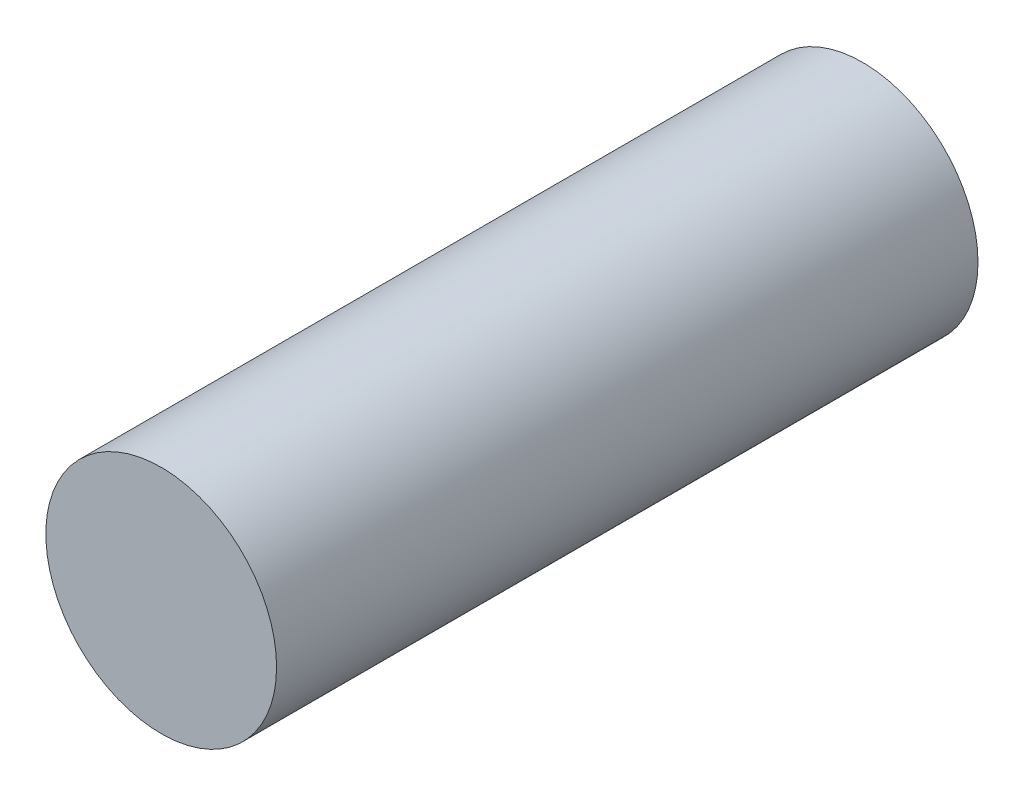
ISO-10303-21;
HEADER;
FILE_DESCRIPTION(('STEP AP214'),'2;1');
FILE_NAME('part.step','',(''),(''),'','','');
FILE_SCHEMA(('AUTOMOTIVE_DESIGN { 1 0 10303 214 1 1 1 1 }'));
ENDSEC;
DATA;
#1=APPLICATION_CONTEXT('core data for automotive mechanical design processes');
#2=APPLICATION_PROTOCOL_DEFINITION('international standard','automotive_design',2000,#1);
#3=PRODUCT_CONTEXT('',#1,'mechanical');
#4=PRODUCT('Part','Part','',(#3));
#5=PRODUCT_RELATED_PRODUCT_CATEGORY('part','',(#4));
#6=PRODUCT_DEFINITION_FORMATION('','',#4);
#7=PRODUCT_DEFINITION_CONTEXT('part definition',#1,'design');
#8=PRODUCT_DEFINITION('design','',#6,#7);
#9=PRODUCT_DEFINITION_SHAPE('','',#8);
#10=(LENGTH_UNIT() NAMED_UNIT(*) SI_UNIT(.MILLI.,.METRE.));
#11=(NAMED_UNIT(*) PLANE_ANGLE_UNIT() SI_UNIT($,.RADIAN.));
#12=(NAMED_UNIT(*) SI_UNIT($,.STERADIAN.) SOLID_ANGLE_UNIT());
#13=UNCERTAINTY_MEASURE_WITH_UNIT(LENGTH_MEASURE(1.E-05),#10,'distance_accuracy_value','');
#14=(GEOMETRIC_REPRESENTATION_CONTEXT(3) GLOBAL_UNCERTAINTY_ASSIGNED_CONTEXT((#13)) GLOBAL_UNIT_ASSIGNED_CONTEXT((#10,
#11,#12)) REPRESENTATION_CONTEXT('',''));
#15=CARTESIAN_POINT('',(0.,0.,0.));
#16=DIRECTION('',(0.,0.,1.));
#17=DIRECTION('',(1.,0.,0.));
#18=AXIS2_PLACEMENT_3D('',#15,#16,#17);
#19=CARTESIAN_POINT('',(0.,0.,19.304));
#20=DIRECTION('',(0.,0.,-1.));
#21=DIRECTION('',(-1.,0.,0.));
#22=AXIS2_PLACEMENT_3D('',#19,#20,#21);
#23=CYLINDRICAL_SURFACE('',#22,3.175);
#24=CARTESIAN_POINT('',(0.,0.,19.304));
#25=DIRECTION('',(0.,0.,1.));
#26=DIRECTION('',(1.,0.,0.));
#27=AXIS2_PLACEMENT_3D('',#24,#25,#26);
#28=CIRCLE('',#27,3.175);
#29=CARTESIAN_POINT('',(3.175,0.,19.304));
#30=VERTEX_POINT('',#29);
#31=EDGE_CURVE('E10',#30,#30,#28,.T.);
#32=ORIENTED_EDGE('',*,*,#31,.F.);
#33=EDGE_LOOP('',(#32));
#34=FACE_BOUND('',#33,.T.);
#35=CARTESIAN_POINT('',(0.,0.,0.));
#36=DIRECTION('',(0.,0.,1.));
#37=DIRECTION('',(1.,0.,0.));
#38=AXIS2_PLACEMENT_3D('',#35,#36,#37);
#39=CIRCLE('',#38,3.175);
#40=CARTESIAN_POINT('',(3.175,0.,0.));
#41=VERTEX_POINT('',#40);
#42=EDGE_CURVE('E34',#41,#41,#39,.T.);
#43=ORIENTED_EDGE('',*,*,#42,.T.);
#44=EDGE_LOOP('',(#43));
#45=FACE_BOUND('',#44,.T.);
#46=ADVANCED_FACE('F28',(#34,#45),#23,.T.);
#47=CARTESIAN_POINT('',(0.,0.,19.304));
#48=DIRECTION('',(0.,0.,1.));
#49=DIRECTION('',(1.,0.,0.));
#50=AXIS2_PLACEMENT_3D('',#47,#48,#49);
#51=PLANE('',#50);
#52=ORIENTED_EDGE('',*,*,#31,.T.);
#53=EDGE_LOOP('',(#52));
#54=FACE_BOUND('',#53,.T.);
#55=ADVANCED_FACE('F43',(#54),#51,.T.);
#56=CARTESIAN_POINT('',(0.,0.,0.));
#57=DIRECTION('',(0.,0.,1.));
#58=DIRECTION('',(1.,0.,0.));
#59=AXIS2_PLACEMENT_3D('',#56,#57,#58);
#60=PLANE('',#59);
#61=ORIENTED_EDGE('',*,*,#42,.F.);
#62=EDGE_LOOP('',(#61));
#63=FACE_BOUND('',#62,.T.);
#64=ADVANCED_FACE('F41',(#63),#60,.F.);
#65=CLOSED_SHELL('',(#46,#55,#64));
#66=MANIFOLD_SOLID_BREP('B2',#65);
#67=ADVANCED_BREP_SHAPE_REPRESENTATION('',(#18,#66),#14);
#68=SHAPE_DEFINITION_REPRESENTATION(#9,#67);
ENDSEC;
END-ISO-10303-21;
